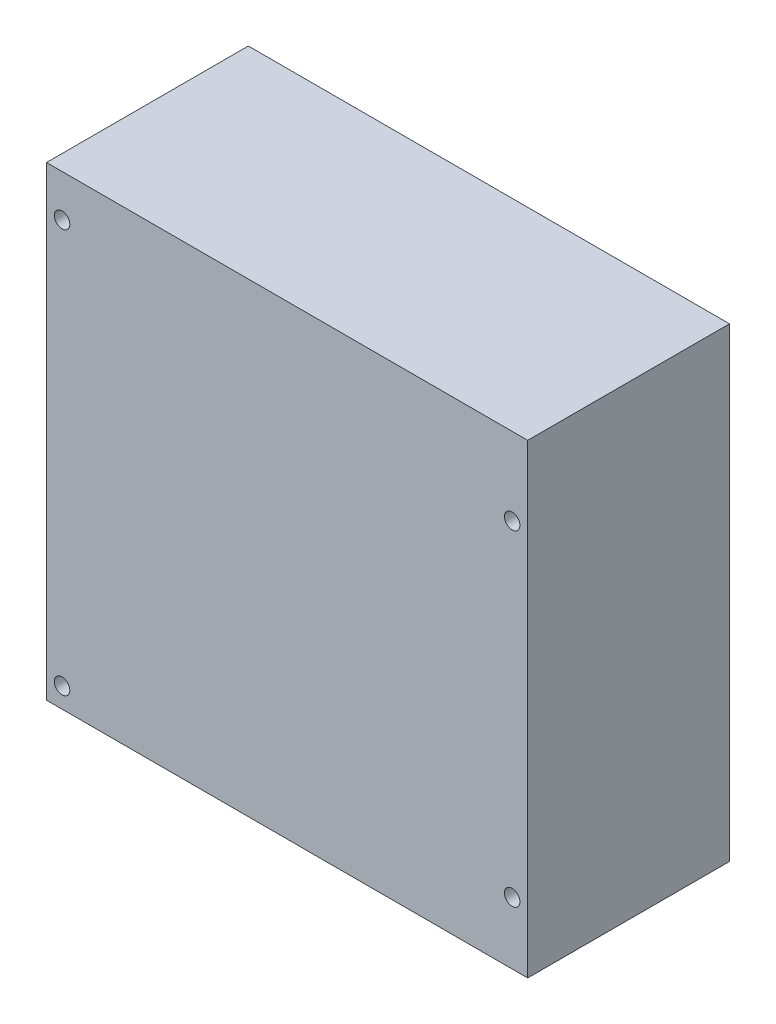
from build123d import *

# Parameters (mm, degrees)
SKETCH1_W           = 78.74
SKETCH1_H           = 76.2
SKETCH1_R           = 1.27
BOSS_EXTRUDE1_DEPTH = 33.02
SKETCH2_R           = 1.27
BOSS_EXTRUDE2_DEPTH = 2.54
SKETCH3_R           = 1.27
BOSS_EXTRUDE3_DEPTH = 2.54


with BuildPart() as part:
    # Sketch1 → Boss-Extrude1 (new body)
    with BuildSketch(Plane.XY):
        Rectangle(SKETCH1_W, SKETCH1_H)
        with Locations((36.83, 25.4)):
            Circle(SKETCH1_R, mode=Mode.SUBTRACT)
        with Locations((36.83, -27.94)):
            Circle(SKETCH1_R, mode=Mode.SUBTRACT)
        with Locations((-36.83, 31.242)):
            Circle(SKETCH1_R, mode=Mode.SUBTRACT)
        with Locations((-36.83, -34.798)):
            Circle(SKETCH1_R, mode=Mode.SUBTRACT)
    extrude(amount=BOSS_EXTRUDE1_DEPTH)

    # Sketch2 → Boss-Extrude2 (add)
    with BuildSketch(Plane(origin=(0, 0, 0), x_dir=(-1, 0, 0), z_dir=(0, 0, -1))):
        with Locations((-36.83, 25.4)):
            Circle(SKETCH2_R)
    extrude(amount=-BOSS_EXTRUDE2_DEPTH)

    # Sketch3 → Boss-Extrude3 (add)
    with BuildSketch(Plane(origin=(0, 0, 0), x_dir=(-1, 0, 0), z_dir=(0, 0, -1))):
        with Locations((36.83, 31.242)):
            Circle(SKETCH3_R)
        with Locations((36.83, -34.798)):
            Circle(SKETCH3_R)
        with Locations((-36.83, -27.94)):
            Circle(SKETCH3_R)
    extrude(amount=-BOSS_EXTRUDE3_DEPTH)


solid = part.part
